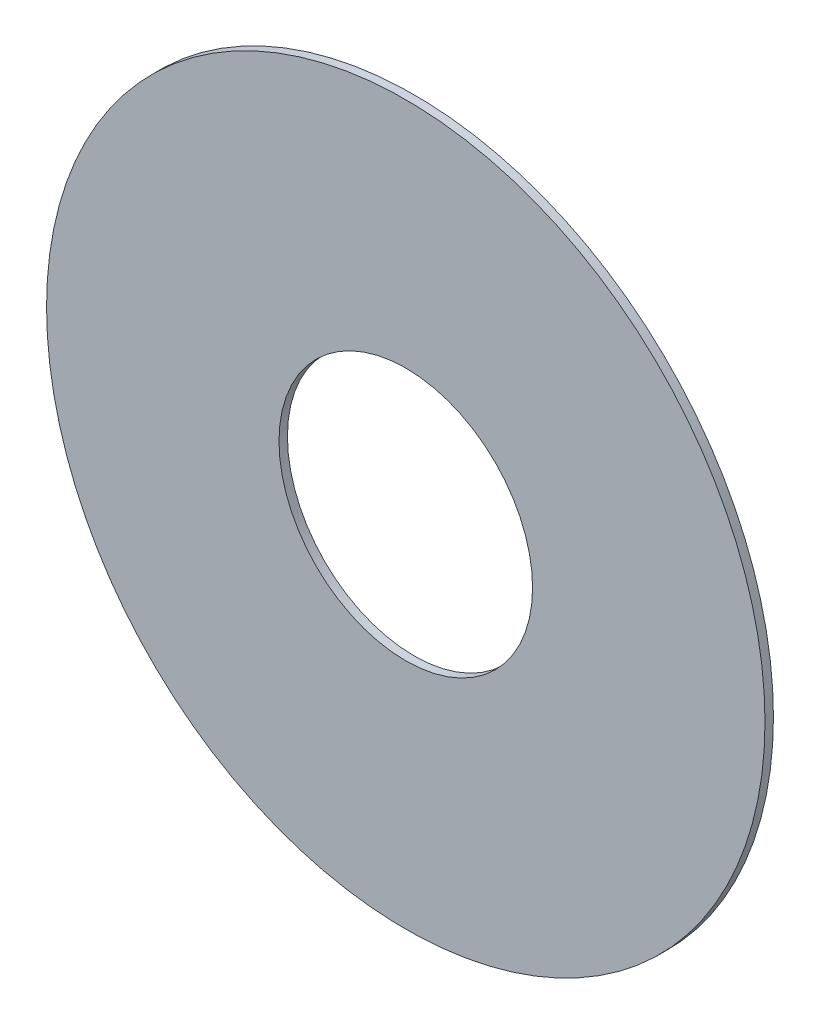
ISO-10303-21;
HEADER;
FILE_DESCRIPTION(('STEP AP214'),'2;1');
FILE_NAME('part.step','',(''),(''),'','','');
FILE_SCHEMA(('AUTOMOTIVE_DESIGN { 1 0 10303 214 1 1 1 1 }'));
ENDSEC;
DATA;
#1=APPLICATION_CONTEXT('core data for automotive mechanical design processes');
#2=APPLICATION_PROTOCOL_DEFINITION('international standard','automotive_design',2000,#1);
#3=PRODUCT_CONTEXT('',#1,'mechanical');
#4=PRODUCT('Part','Part','',(#3));
#5=PRODUCT_RELATED_PRODUCT_CATEGORY('part','',(#4));
#6=PRODUCT_DEFINITION_FORMATION('','',#4);
#7=PRODUCT_DEFINITION_CONTEXT('part definition',#1,'design');
#8=PRODUCT_DEFINITION('design','',#6,#7);
#9=PRODUCT_DEFINITION_SHAPE('','',#8);
#10=(LENGTH_UNIT() NAMED_UNIT(*) SI_UNIT(.MILLI.,.METRE.));
#11=(NAMED_UNIT(*) PLANE_ANGLE_UNIT() SI_UNIT($,.RADIAN.));
#12=(NAMED_UNIT(*) SI_UNIT($,.STERADIAN.) SOLID_ANGLE_UNIT());
#13=UNCERTAINTY_MEASURE_WITH_UNIT(LENGTH_MEASURE(1.E-05),#10,'distance_accuracy_value','');
#14=(GEOMETRIC_REPRESENTATION_CONTEXT(3) GLOBAL_UNCERTAINTY_ASSIGNED_CONTEXT((#13)) GLOBAL_UNIT_ASSIGNED_CONTEXT((#10,
#11,#12)) REPRESENTATION_CONTEXT('',''));
#15=CARTESIAN_POINT('',(0.,0.,0.));
#16=DIRECTION('',(0.,0.,1.));
#17=DIRECTION('',(1.,0.,0.));
#18=AXIS2_PLACEMENT_3D('',#15,#16,#17);
#19=CARTESIAN_POINT('',(0.,0.,0.));
#20=DIRECTION('',(0.,0.,-1.));
#21=DIRECTION('',(-1.,0.,0.));
#22=AXIS2_PLACEMENT_3D('',#19,#20,#21);
#23=CYLINDRICAL_SURFACE('',#22,8.50000000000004);
#24=CARTESIAN_POINT('',(0.,0.,0.));
#25=DIRECTION('',(0.,0.,-1.));
#26=DIRECTION('',(1.,0.,0.));
#27=AXIS2_PLACEMENT_3D('',#24,#25,#26);
#28=CIRCLE('',#27,8.50000000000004);
#29=CARTESIAN_POINT('',(8.50000000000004,0.,0.));
#30=VERTEX_POINT('',#29);
#31=EDGE_CURVE('E10',#30,#30,#28,.T.);
#32=ORIENTED_EDGE('',*,*,#31,.T.);
#33=EDGE_LOOP('',(#32));
#34=FACE_BOUND('',#33,.T.);
#35=CARTESIAN_POINT('',(0.,0.,-0.2));
#36=DIRECTION('',(0.,0.,-1.));
#37=DIRECTION('',(1.,0.,0.));
#38=AXIS2_PLACEMENT_3D('',#35,#36,#37);
#39=CIRCLE('',#38,8.50000000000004);
#40=CARTESIAN_POINT('',(8.50000000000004,0.,-0.2));
#41=VERTEX_POINT('',#40);
#42=EDGE_CURVE('E354',#41,#41,#39,.T.);
#43=ORIENTED_EDGE('',*,*,#42,.F.);
#44=EDGE_LOOP('',(#43));
#45=FACE_BOUND('',#44,.T.);
#46=ADVANCED_FACE('F348',(#34,#45),#23,.T.);
#47=CARTESIAN_POINT('',(0.,0.,0.));
#48=DIRECTION('',(0.,0.,1.));
#49=DIRECTION('',(1.,0.,0.));
#50=AXIS2_PLACEMENT_3D('',#47,#48,#49);
#51=PLANE('',#50);
#52=CARTESIAN_POINT('',(0.,0.,0.));
#53=DIRECTION('',(0.,0.,-1.));
#54=DIRECTION('',(1.,0.,0.));
#55=AXIS2_PLACEMENT_3D('',#52,#53,#54);
#56=CIRCLE('',#55,3.00000000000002);
#57=CARTESIAN_POINT('',(3.00000000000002,0.,0.));
#58=VERTEX_POINT('',#57);
#59=EDGE_CURVE('E358',#58,#58,#56,.T.);
#60=ORIENTED_EDGE('',*,*,#59,.T.);
#61=EDGE_LOOP('',(#60));
#62=FACE_BOUND('',#61,.T.);
#63=ORIENTED_EDGE('',*,*,#31,.F.);
#64=EDGE_LOOP('',(#63));
#65=FACE_BOUND('',#64,.T.);
#66=ADVANCED_FACE('F372',(#62,#65),#51,.T.);
#67=CARTESIAN_POINT('',(0.,0.,-0.2));
#68=DIRECTION('',(0.,0.,1.));
#69=DIRECTION('',(1.,0.,0.));
#70=AXIS2_PLACEMENT_3D('',#67,#68,#69);
#71=PLANE('',#70);
#72=CARTESIAN_POINT('',(0.,0.,-0.2));
#73=DIRECTION('',(0.,0.,-1.));
#74=DIRECTION('',(1.,0.,0.));
#75=AXIS2_PLACEMENT_3D('',#72,#73,#74);
#76=CIRCLE('',#75,3.00000000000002);
#77=CARTESIAN_POINT('',(3.00000000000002,0.,-0.2));
#78=VERTEX_POINT('',#77);
#79=EDGE_CURVE('E362',#78,#78,#76,.T.);
#80=ORIENTED_EDGE('',*,*,#79,.F.);
#81=EDGE_LOOP('',(#80));
#82=FACE_BOUND('',#81,.T.);
#83=ORIENTED_EDGE('',*,*,#42,.T.);
#84=EDGE_LOOP('',(#83));
#85=FACE_BOUND('',#84,.T.);
#86=ADVANCED_FACE('F370',(#82,#85),#71,.F.);
#87=CARTESIAN_POINT('',(0.,0.,0.));
#88=DIRECTION('',(0.,0.,-1.));
#89=DIRECTION('',(-1.,0.,0.));
#90=AXIS2_PLACEMENT_3D('',#87,#88,#89);
#91=CYLINDRICAL_SURFACE('',#90,3.00000000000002);
#92=ORIENTED_EDGE('',*,*,#59,.F.);
#93=EDGE_LOOP('',(#92));
#94=FACE_BOUND('',#93,.T.);
#95=ORIENTED_EDGE('',*,*,#79,.T.);
#96=EDGE_LOOP('',(#95));
#97=FACE_BOUND('',#96,.T.);
#98=ADVANCED_FACE('F368',(#94,#97),#91,.F.);
#99=CLOSED_SHELL('',(#46,#66,#86,#98));
#100=MANIFOLD_SOLID_BREP('B2',#99);
#101=ADVANCED_BREP_SHAPE_REPRESENTATION('',(#18,#100),#14);
#102=SHAPE_DEFINITION_REPRESENTATION(#9,#101);
ENDSEC;
END-ISO-10303-21;
